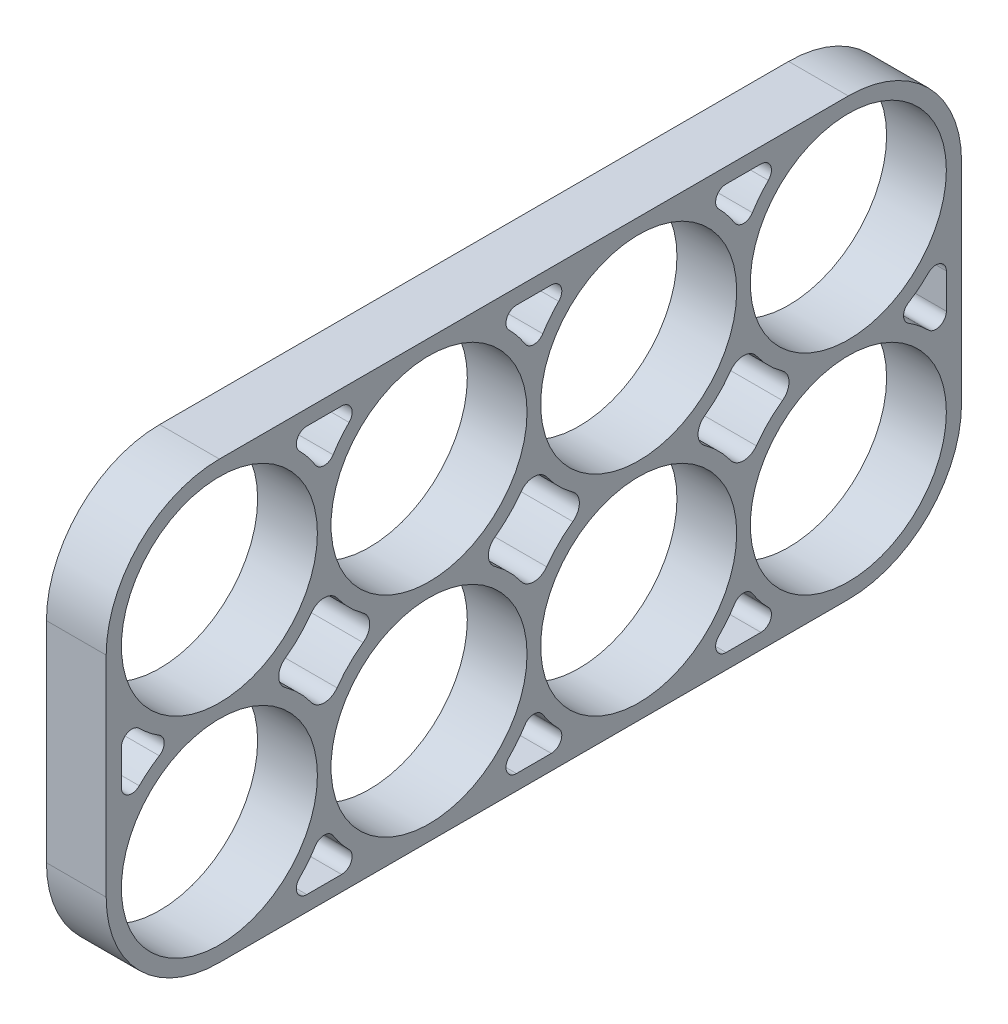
from build123d import *

# Parameters (mm, degrees)
SKIZZE1_R                       = 9.35
AUFSATZ_LINEAR_AUSTRAGEN1_DEPTH = 5.7


with BuildPart() as part:
    # Skizze1 → Aufsatz-Linear austragen1 (new body)
    with BuildSketch(Plane(origin=(0, 0, 0), x_dir=(0, 0, -1), z_dir=(1, 0, 0))):
        with BuildLine():
            Line((-30, 20.8), (30, 20.8))
            ThreePointArc((30, 20.8), (37.636753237, 17.636753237), (40.8, 10))
            Line((40.8, 10), (40.8, -10))
            ThreePointArc((40.8, -10), (37.636753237, -17.636753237), (30, -20.8))
            Line((30, -20.8), (-30, -20.8))
            ThreePointArc((-30, -20.8), (-37.636753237, -17.636753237), (-40.8, -10))
            Line((-40.8, -10), (-40.8, 10))
            ThreePointArc((-40.8, 10), (-37.636753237, 17.636753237), (-30, 20.8))
        make_face()
        with Locations((-30, 10)):
            Circle(SKIZZE1_R, mode=Mode.SUBTRACT)
        with Locations((-10, 10)):
            Circle(SKIZZE1_R, mode=Mode.SUBTRACT)
        with Locations((10, 10)):
            Circle(SKIZZE1_R, mode=Mode.SUBTRACT)
        with Locations((30, 10)):
            Circle(SKIZZE1_R, mode=Mode.SUBTRACT)
        with Locations((30, -10)):
            Circle(SKIZZE1_R, mode=Mode.SUBTRACT)
        with Locations((10, -10)):
            Circle(SKIZZE1_R, mode=Mode.SUBTRACT)
        with Locations((-10, -10)):
            Circle(SKIZZE1_R, mode=Mode.SUBTRACT)
        with Locations((-30, -10)):
            Circle(SKIZZE1_R, mode=Mode.SUBTRACT)
        with BuildLine():
            Line((-21.662284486, 19.35), (-18.337715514, 19.35))
            ThreePointArc((-18.337715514, 19.35), (-17.41369519, 18.732343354), (-17.631129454, 17.642372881))
            ThreePointArc((-17.631129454, 17.642372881), (-18.445947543, 16.730970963), (-19.152542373, 15.733320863))
            ThreePointArc((-19.152542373, 15.733320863), (-20, 15.264183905), (-20.847457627, 15.733320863))
            ThreePointArc((-20.847457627, 15.733320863), (-21.554052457, 16.730970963), (-22.368870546, 17.642372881))
            ThreePointArc((-22.368870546, 17.642372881), (-22.58630481, 18.732343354), (-21.662284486, 19.35))
        make_face(mode=Mode.SUBTRACT)
        with BuildLine():
            Line((18.337715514, 19.35), (21.662284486, 19.35))
            ThreePointArc((21.662284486, 19.35), (22.58630481, 18.732343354), (22.368870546, 17.642372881))
            ThreePointArc((22.368870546, 17.642372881), (21.554052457, 16.730970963), (20.847457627, 15.733320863))
            ThreePointArc((20.847457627, 15.733320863), (20, 15.264183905), (19.152542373, 15.733320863))
            ThreePointArc((19.152542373, 15.733320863), (18.445947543, 16.730970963), (17.631129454, 17.642372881))
            ThreePointArc((17.631129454, 17.642372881), (17.41369519, 18.732343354), (18.337715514, 19.35))
        make_face(mode=Mode.SUBTRACT)
        with BuildLine():
            Line((21.662284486, -19.35), (18.337715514, -19.35))
            ThreePointArc((18.337715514, -19.35), (17.41369519, -18.732343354), (17.631129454, -17.642372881))
            ThreePointArc((17.631129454, -17.642372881), (18.445947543, -16.730970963), (19.152542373, -15.733320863))
            ThreePointArc((19.152542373, -15.733320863), (20, -15.264183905), (20.847457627, -15.733320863))
            ThreePointArc((20.847457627, -15.733320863), (21.554052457, -16.730970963), (22.368870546, -17.642372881))
            ThreePointArc((22.368870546, -17.642372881), (22.58630481, -18.732343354), (21.662284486, -19.35))
        make_face(mode=Mode.SUBTRACT)
        with BuildLine():
            Line((-39.35, 1.662284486), (-39.35, -1.662284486))
            ThreePointArc((-39.35, -1.662284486), (-38.732343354, -2.58630481), (-37.642372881, -2.368870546))
            ThreePointArc((-37.642372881, -2.368870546), (-36.730970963, -1.554052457), (-35.733320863, -0.847457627))
            ThreePointArc((-35.733320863, -0.847457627), (-35.264183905, 0), (-35.733320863, 0.847457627))
            ThreePointArc((-35.733320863, 0.847457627), (-36.730970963, 1.554052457), (-37.642372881, 2.368870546))
            ThreePointArc((-37.642372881, 2.368870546), (-38.732343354, 2.58630481), (-39.35, 1.662284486))
        make_face(mode=Mode.SUBTRACT)
        with BuildLine():
            Line((39.35, -1.662284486), (39.35, 1.662284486))
            ThreePointArc((39.35, 1.662284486), (38.732343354, 2.58630481), (37.642372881, 2.368870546))
            ThreePointArc((37.642372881, 2.368870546), (36.730970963, 1.554052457), (35.733320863, 0.847457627))
            ThreePointArc((35.733320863, 0.847457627), (35.264183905, 0), (35.733320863, -0.847457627))
            ThreePointArc((35.733320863, -0.847457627), (36.730970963, -1.554052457), (37.642372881, -2.368870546))
            ThreePointArc((37.642372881, -2.368870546), (38.732343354, -2.58630481), (39.35, -1.662284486))
        make_face(mode=Mode.SUBTRACT)
        with BuildLine():
            Line((-1.662284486, 19.35), (1.662284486, 19.35))
            ThreePointArc((1.662284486, 19.35), (2.58630481, 18.732343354), (2.368870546, 17.642372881))
            ThreePointArc((2.368870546, 17.642372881), (1.554052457, 16.730970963), (0.847457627, 15.733320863))
            ThreePointArc((0.847457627, 15.733320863), (0, 15.264183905), (-0.847457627, 15.733320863))
            ThreePointArc((-0.847457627, 15.733320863), (-1.554052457, 16.730970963), (-2.368870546, 17.642372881))
            ThreePointArc((-2.368870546, 17.642372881), (-2.58630481, 18.732343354), (-1.662284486, 19.35))
        make_face(mode=Mode.SUBTRACT)
        with BuildLine():
            Line((-18.337715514, -19.35), (-21.662284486, -19.35))
            ThreePointArc((-21.662284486, -19.35), (-22.58630481, -18.732343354), (-22.368870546, -17.642372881))
            ThreePointArc((-22.368870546, -17.642372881), (-21.554052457, -16.730970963), (-20.847457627, -15.733320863))
            ThreePointArc((-20.847457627, -15.733320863), (-20, -15.264183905), (-19.152542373, -15.733320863))
            ThreePointArc((-19.152542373, -15.733320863), (-18.445947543, -16.730970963), (-17.631129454, -17.642372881))
            ThreePointArc((-17.631129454, -17.642372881), (-17.41369519, -18.732343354), (-18.337715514, -19.35))
        make_face(mode=Mode.SUBTRACT)
        with BuildLine():
            Line((1.662284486, -19.35), (-1.662284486, -19.35))
            ThreePointArc((-1.662284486, -19.35), (-2.58630481, -18.732343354), (-2.368870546, -17.642372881))
            ThreePointArc((-2.368870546, -17.642372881), (-1.554052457, -16.730970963), (-0.847457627, -15.733320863))
            ThreePointArc((-0.847457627, -15.733320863), (0, -15.264183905), (0.847457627, -15.733320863))
            ThreePointArc((0.847457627, -15.733320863), (1.554052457, -16.730970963), (2.368870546, -17.642372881))
            ThreePointArc((2.368870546, -17.642372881), (2.58630481, -18.732343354), (1.662284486, -19.35))
        make_face(mode=Mode.SUBTRACT)
        with BuildLine():
            ThreePointArc((-23.711674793, 1.219512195), (-22.363246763, 2.363246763), (-21.219512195, 3.711674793))
            ThreePointArc((-21.219512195, 3.711674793), (-20, 4.338296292), (-18.780487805, 3.711674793))
            ThreePointArc((-18.780487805, 3.711674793), (-17.636753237, 2.363246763), (-16.288325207, 1.219512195))
            ThreePointArc((-16.288325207, 1.219512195), (-15.661703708, 0), (-16.288325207, -1.219512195))
            ThreePointArc((-16.288325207, -1.219512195), (-17.636753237, -2.363246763), (-18.780487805, -3.711674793))
            ThreePointArc((-18.780487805, -3.711674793), (-20, -4.338296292), (-21.219512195, -3.711674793))
            ThreePointArc((-21.219512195, -3.711674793), (-22.363246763, -2.363246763), (-23.711674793, -1.219512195))
            ThreePointArc((-23.711674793, -1.219512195), (-24.338296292, 0), (-23.711674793, 1.219512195))
        make_face(mode=Mode.SUBTRACT)
        with BuildLine():
            ThreePointArc((-3.711674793, 1.219512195), (-2.363246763, 2.363246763), (-1.219512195, 3.711674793))
            ThreePointArc((-1.219512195, 3.711674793), (0, 4.338296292), (1.219512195, 3.711674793))
            ThreePointArc((1.219512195, 3.711674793), (2.363246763, 2.363246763), (3.711674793, 1.219512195))
            ThreePointArc((3.711674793, 1.219512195), (4.338296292, 0), (3.711674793, -1.219512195))
            ThreePointArc((3.711674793, -1.219512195), (2.363246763, -2.363246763), (1.219512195, -3.711674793))
            ThreePointArc((1.219512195, -3.711674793), (0, -4.338296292), (-1.219512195, -3.711674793))
            ThreePointArc((-1.219512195, -3.711674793), (-2.363246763, -2.363246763), (-3.711674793, -1.219512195))
            ThreePointArc((-3.711674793, -1.219512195), (-4.338296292, 0), (-3.711674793, 1.219512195))
        make_face(mode=Mode.SUBTRACT)
        with BuildLine():
            ThreePointArc((16.288325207, 1.219512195), (17.636753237, 2.363246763), (18.780487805, 3.711674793))
            ThreePointArc((18.780487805, 3.711674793), (20, 4.338296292), (21.219512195, 3.711674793))
            ThreePointArc((21.219512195, 3.711674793), (22.363246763, 2.363246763), (23.711674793, 1.219512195))
            ThreePointArc((23.711674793, 1.219512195), (24.338296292, 0), (23.711674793, -1.219512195))
            ThreePointArc((23.711674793, -1.219512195), (22.363246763, -2.363246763), (21.219512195, -3.711674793))
            ThreePointArc((21.219512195, -3.711674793), (20, -4.338296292), (18.780487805, -3.711674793))
            ThreePointArc((18.780487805, -3.711674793), (17.636753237, -2.363246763), (16.288325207, -1.219512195))
            ThreePointArc((16.288325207, -1.219512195), (15.661703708, 0), (16.288325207, 1.219512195))
        make_face(mode=Mode.SUBTRACT)
    extrude(amount=AUFSATZ_LINEAR_AUSTRAGEN1_DEPTH)


solid = part.part
